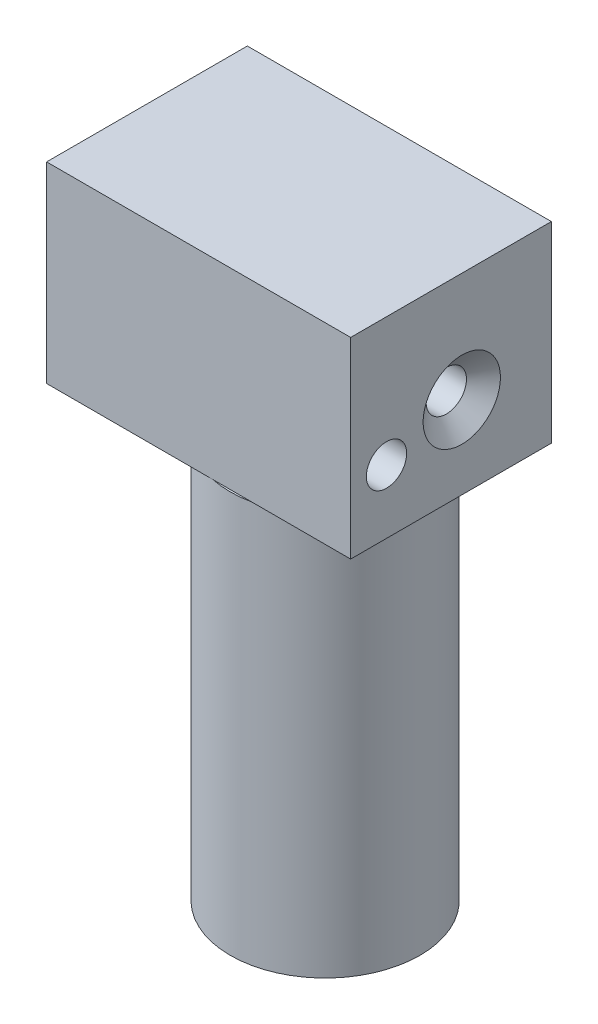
ISO-10303-21;
HEADER;
FILE_DESCRIPTION(('STEP AP214'),'2;1');
FILE_NAME('part.step','',(''),(''),'','','');
FILE_SCHEMA(('AUTOMOTIVE_DESIGN { 1 0 10303 214 1 1 1 1 }'));
ENDSEC;
DATA;
#1=APPLICATION_CONTEXT('core data for automotive mechanical design processes');
#2=APPLICATION_PROTOCOL_DEFINITION('international standard','automotive_design',2000,#1);
#3=PRODUCT_CONTEXT('',#1,'mechanical');
#4=PRODUCT('Part','Part','',(#3));
#5=PRODUCT_RELATED_PRODUCT_CATEGORY('part','',(#4));
#6=PRODUCT_DEFINITION_FORMATION('','',#4);
#7=PRODUCT_DEFINITION_CONTEXT('part definition',#1,'design');
#8=PRODUCT_DEFINITION('design','',#6,#7);
#9=PRODUCT_DEFINITION_SHAPE('','',#8);
#10=(LENGTH_UNIT() NAMED_UNIT(*) SI_UNIT(.MILLI.,.METRE.));
#11=(NAMED_UNIT(*) PLANE_ANGLE_UNIT() SI_UNIT($,.RADIAN.));
#12=(NAMED_UNIT(*) SI_UNIT($,.STERADIAN.) SOLID_ANGLE_UNIT());
#13=UNCERTAINTY_MEASURE_WITH_UNIT(LENGTH_MEASURE(1.E-05),#10,'distance_accuracy_value','');
#14=(GEOMETRIC_REPRESENTATION_CONTEXT(3) GLOBAL_UNCERTAINTY_ASSIGNED_CONTEXT((#13)) GLOBAL_UNIT_ASSIGNED_CONTEXT((#10,
#11,#12)) REPRESENTATION_CONTEXT('',''));
#15=CARTESIAN_POINT('',(0.,0.,0.));
#16=DIRECTION('',(0.,0.,1.));
#17=DIRECTION('',(1.,0.,0.));
#18=AXIS2_PLACEMENT_3D('',#15,#16,#17);
#19=CARTESIAN_POINT('',(-8.73607897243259,-5.44469898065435,25.4));
#20=DIRECTION('',(0.,1.,0.));
#21=DIRECTION('',(0.,0.,1.));
#22=AXIS2_PLACEMENT_3D('',#19,#20,#21);
#23=PLANE('',#22);
#24=CARTESIAN_POINT('',(14.7615659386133,-5.44469898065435,13.6554974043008));
#25=DIRECTION('',(0.,-1.,0.));
#26=DIRECTION('',(0.,0.,-1.));
#27=AXIS2_PLACEMENT_3D('',#24,#25,#26);
#28=CIRCLE('',#27,12.0013083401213);
#29=CARTESIAN_POINT('',(12.2921407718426,-5.44469898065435,25.4));
#30=VERTEX_POINT('',#29);
#31=CARTESIAN_POINT('',(17.230991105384,-5.44469898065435,25.4));
#32=VERTEX_POINT('',#31);
#33=EDGE_CURVE('E11',#30,#32,#28,.T.);
#34=ORIENTED_EDGE('',*,*,#33,.F.);
#35=DIRECTION('',(1.,0.,0.));
#36=VECTOR('',#35,1.);
#37=CARTESIAN_POINT('',(-8.73607897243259,-5.44469898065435,25.4));
#38=LINE('',#37,#36);
#39=CARTESIAN_POINT('',(-8.73607897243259,-5.44469898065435,25.4));
#40=VERTEX_POINT('',#39);
#41=EDGE_CURVE('E90',#40,#30,#38,.T.);
#42=ORIENTED_EDGE('',*,*,#41,.F.);
#43=DIRECTION('',(0.,0.,-1.));
#44=VECTOR('',#43,1.);
#45=CARTESIAN_POINT('',(-8.73607897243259,-5.44469898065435,25.4));
#46=LINE('',#45,#44);
#47=CARTESIAN_POINT('',(-8.73607897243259,-5.44469898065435,0.));
#48=VERTEX_POINT('',#47);
#49=EDGE_CURVE('E45',#40,#48,#46,.T.);
#50=ORIENTED_EDGE('',*,*,#49,.T.);
#51=DIRECTION('',(1.,0.,0.));
#52=VECTOR('',#51,1.);
#53=CARTESIAN_POINT('',(-8.73607897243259,-5.44469898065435,0.));
#54=LINE('',#53,#52);
#55=CARTESIAN_POINT('',(29.7403417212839,-5.44469898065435,0.));
#56=VERTEX_POINT('',#55);
#57=EDGE_CURVE('E138',#48,#56,#54,.T.);
#58=ORIENTED_EDGE('',*,*,#57,.T.);
#59=DIRECTION('',(0.,0.,-1.));
#60=VECTOR('',#59,1.);
#61=CARTESIAN_POINT('',(29.7403417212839,-5.44469898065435,25.4));
#62=LINE('',#61,#60);
#63=CARTESIAN_POINT('',(29.7403417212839,-5.44469898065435,25.4));
#64=VERTEX_POINT('',#63);
#65=EDGE_CURVE('E145',#64,#56,#62,.T.);
#66=ORIENTED_EDGE('',*,*,#65,.F.);
#67=EDGE_CURVE('E129',#32,#64,#38,.T.);
#68=ORIENTED_EDGE('',*,*,#67,.F.);
#69=EDGE_LOOP('',(#34,#42,#50,#58,#66,#68));
#70=FACE_BOUND('',#69,.T.);
#71=ADVANCED_FACE('F41',(#70),#23,.F.);
#72=CARTESIAN_POINT('',(-8.73607897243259,-5.44469898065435,25.4));
#73=DIRECTION('',(1.,0.,0.));
#74=DIRECTION('',(0.,0.,-1.));
#75=AXIS2_PLACEMENT_3D('',#72,#73,#74);
#76=PLANE('',#75);
#77=CARTESIAN_POINT('',(-8.73607897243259,4.98819251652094,11.3361126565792));
#78=DIRECTION('',(1.,0.,0.));
#79=DIRECTION('',(0.,0.,-1.));
#80=AXIS2_PLACEMENT_3D('',#77,#78,#79);
#81=CIRCLE('',#80,2.55269999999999);
#82=CARTESIAN_POINT('',(-8.73607897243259,4.98819251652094,8.7834126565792));
#83=VERTEX_POINT('',#82);
#84=EDGE_CURVE('E108',#83,#83,#81,.T.);
#85=ORIENTED_EDGE('',*,*,#84,.T.);
#86=EDGE_LOOP('',(#85));
#87=FACE_BOUND('',#86,.T.);
#88=DIRECTION('',(0.,-1.,0.));
#89=VECTOR('',#88,1.);
#90=CARTESIAN_POINT('',(-8.73607897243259,-5.44469898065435,0.));
#91=LINE('',#90,#89);
#92=CARTESIAN_POINT('',(-8.73607897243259,18.8497076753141,0.));
#93=VERTEX_POINT('',#92);
#94=EDGE_CURVE('E124',#93,#48,#91,.T.);
#95=ORIENTED_EDGE('',*,*,#94,.T.);
#96=ORIENTED_EDGE('',*,*,#49,.F.);
#97=DIRECTION('',(0.,-1.,0.));
#98=VECTOR('',#97,1.);
#99=CARTESIAN_POINT('',(-8.73607897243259,-5.44469898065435,25.4));
#100=LINE('',#99,#98);
#101=CARTESIAN_POINT('',(-8.73607897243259,18.8497076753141,25.4));
#102=VERTEX_POINT('',#101);
#103=EDGE_CURVE('E127',#102,#40,#100,.T.);
#104=ORIENTED_EDGE('',*,*,#103,.F.);
#105=DIRECTION('',(0.,0.,-1.));
#106=VECTOR('',#105,1.);
#107=CARTESIAN_POINT('',(-8.73607897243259,18.8497076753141,25.4));
#108=LINE('',#107,#106);
#109=EDGE_CURVE('E135',#102,#93,#108,.T.);
#110=ORIENTED_EDGE('',*,*,#109,.T.);
#111=EDGE_LOOP('',(#95,#96,#104,#110));
#112=FACE_BOUND('',#111,.T.);
#113=ADVANCED_FACE('F43',(#87,#112),#76,.F.);
#114=CARTESIAN_POINT('',(29.7403417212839,-5.44469898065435,25.4));
#115=DIRECTION('',(-1.,0.,0.));
#116=DIRECTION('',(0.,0.,1.));
#117=AXIS2_PLACEMENT_3D('',#114,#115,#116);
#118=PLANE('',#117);
#119=CARTESIAN_POINT('',(29.7403417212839,2.60694251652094,20.8611126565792));
#120=DIRECTION('',(1.,0.,0.));
#121=DIRECTION('',(0.,0.,-1.));
#122=AXIS2_PLACEMENT_3D('',#119,#120,#121);
#123=CIRCLE('',#122,2.5527);
#124=CARTESIAN_POINT('',(29.7403417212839,2.60694251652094,18.3084126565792));
#125=VERTEX_POINT('',#124);
#126=EDGE_CURVE('E109',#125,#125,#123,.T.);
#127=ORIENTED_EDGE('',*,*,#126,.F.);
#128=EDGE_LOOP('',(#127));
#129=FACE_BOUND('',#128,.T.);
#130=CARTESIAN_POINT('',(29.7403417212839,4.98819251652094,11.3361126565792));
#131=DIRECTION('',(1.,0.,0.));
#132=DIRECTION('',(0.,0.,-1.));
#133=AXIS2_PLACEMENT_3D('',#130,#131,#132);
#134=CIRCLE('',#133,4.8895);
#135=CARTESIAN_POINT('',(29.7403417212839,4.98819251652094,6.44661265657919));
#136=VERTEX_POINT('',#135);
#137=EDGE_CURVE('E119',#136,#136,#134,.T.);
#138=ORIENTED_EDGE('',*,*,#137,.F.);
#139=EDGE_LOOP('',(#138));
#140=FACE_BOUND('',#139,.T.);
#141=DIRECTION('',(0.,1.,0.));
#142=VECTOR('',#141,1.);
#143=CARTESIAN_POINT('',(29.7403417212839,-5.44469898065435,0.));
#144=LINE('',#143,#142);
#145=CARTESIAN_POINT('',(29.7403417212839,18.8497076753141,0.));
#146=VERTEX_POINT('',#145);
#147=EDGE_CURVE('E140',#56,#146,#144,.T.);
#148=ORIENTED_EDGE('',*,*,#147,.T.);
#149=DIRECTION('',(0.,0.,-1.));
#150=VECTOR('',#149,1.);
#151=CARTESIAN_POINT('',(29.7403417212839,18.8497076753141,25.4));
#152=LINE('',#151,#150);
#153=CARTESIAN_POINT('',(29.7403417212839,18.8497076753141,25.4));
#154=VERTEX_POINT('',#153);
#155=EDGE_CURVE('E144',#154,#146,#152,.T.);
#156=ORIENTED_EDGE('',*,*,#155,.F.);
#157=DIRECTION('',(0.,1.,0.));
#158=VECTOR('',#157,1.);
#159=CARTESIAN_POINT('',(29.7403417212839,-5.44469898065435,25.4));
#160=LINE('',#159,#158);
#161=EDGE_CURVE('E131',#64,#154,#160,.T.);
#162=ORIENTED_EDGE('',*,*,#161,.F.);
#163=ORIENTED_EDGE('',*,*,#65,.T.);
#164=EDGE_LOOP('',(#148,#156,#162,#163));
#165=FACE_BOUND('',#164,.T.);
#166=ADVANCED_FACE('F158',(#129,#140,#165),#118,.F.);
#167=CARTESIAN_POINT('',(-8.73607897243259,18.8497076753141,25.4));
#168=DIRECTION('',(0.,-1.,0.));
#169=DIRECTION('',(0.,0.,-1.));
#170=AXIS2_PLACEMENT_3D('',#167,#168,#169);
#171=PLANE('',#170);
#172=DIRECTION('',(-1.,0.,0.));
#173=VECTOR('',#172,1.);
#174=CARTESIAN_POINT('',(-8.73607897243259,18.8497076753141,0.));
#175=LINE('',#174,#173);
#176=EDGE_CURVE('E86',#146,#93,#175,.T.);
#177=ORIENTED_EDGE('',*,*,#176,.T.);
#178=ORIENTED_EDGE('',*,*,#109,.F.);
#179=DIRECTION('',(-1.,0.,0.));
#180=VECTOR('',#179,1.);
#181=CARTESIAN_POINT('',(-8.73607897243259,18.8497076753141,25.4));
#182=LINE('',#181,#180);
#183=EDGE_CURVE('E65',#154,#102,#182,.T.);
#184=ORIENTED_EDGE('',*,*,#183,.F.);
#185=ORIENTED_EDGE('',*,*,#155,.T.);
#186=EDGE_LOOP('',(#177,#178,#184,#185));
#187=FACE_BOUND('',#186,.T.);
#188=ADVANCED_FACE('F159',(#187),#171,.F.);
#189=CARTESIAN_POINT('',(-8.73607897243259,18.8497076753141,25.4));
#190=DIRECTION('',(0.,0.,-1.));
#191=DIRECTION('',(-1.,0.,0.));
#192=AXIS2_PLACEMENT_3D('',#189,#190,#191);
#193=PLANE('',#192);
#194=ORIENTED_EDGE('',*,*,#103,.T.);
#195=ORIENTED_EDGE('',*,*,#41,.T.);
#196=EDGE_CURVE('E132',#30,#32,#38,.T.);
#197=ORIENTED_EDGE('',*,*,#196,.T.);
#198=ORIENTED_EDGE('',*,*,#67,.T.);
#199=ORIENTED_EDGE('',*,*,#161,.T.);
#200=ORIENTED_EDGE('',*,*,#183,.T.);
#201=EDGE_LOOP('',(#194,#195,#197,#198,#199,#200));
#202=FACE_BOUND('',#201,.T.);
#203=ADVANCED_FACE('F160',(#202),#193,.F.);
#204=CARTESIAN_POINT('',(-8.73607897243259,18.8497076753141,0.));
#205=DIRECTION('',(0.,0.,-1.));
#206=DIRECTION('',(-1.,0.,0.));
#207=AXIS2_PLACEMENT_3D('',#204,#205,#206);
#208=PLANE('',#207);
#209=ORIENTED_EDGE('',*,*,#94,.F.);
#210=ORIENTED_EDGE('',*,*,#176,.F.);
#211=ORIENTED_EDGE('',*,*,#147,.F.);
#212=ORIENTED_EDGE('',*,*,#57,.F.);
#213=EDGE_LOOP('',(#209,#210,#211,#212));
#214=FACE_BOUND('',#213,.T.);
#215=ADVANCED_FACE('F156',(#214),#208,.T.);
#216=CARTESIAN_POINT('',(14.7615659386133,-56.2446989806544,13.6554974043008));
#217=DIRECTION('',(0.,1.,0.));
#218=DIRECTION('',(0.,0.,1.));
#219=AXIS2_PLACEMENT_3D('',#216,#217,#218);
#220=CYLINDRICAL_SURFACE('',#219,12.0013083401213);
#221=CARTESIAN_POINT('',(14.7615659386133,-56.2446989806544,13.6554974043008));
#222=DIRECTION('',(0.,-1.,0.));
#223=DIRECTION('',(0.,0.,-1.));
#224=AXIS2_PLACEMENT_3D('',#221,#222,#223);
#225=CIRCLE('',#224,12.0013083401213);
#226=CARTESIAN_POINT('',(14.7615659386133,-56.2446989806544,1.65418906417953));
#227=VERTEX_POINT('',#226);
#228=EDGE_CURVE('E122',#227,#227,#225,.T.);
#229=ORIENTED_EDGE('',*,*,#228,.F.);
#230=EDGE_LOOP('',(#229));
#231=FACE_BOUND('',#230,.T.);
#232=EDGE_CURVE('E51',#32,#30,#28,.T.);
#233=ORIENTED_EDGE('',*,*,#232,.T.);
#234=ORIENTED_EDGE('',*,*,#33,.T.);
#235=EDGE_LOOP('',(#233,#234));
#236=FACE_BOUND('',#235,.T.);
#237=ADVANCED_FACE('F166',(#231,#236),#220,.T.);
#238=CARTESIAN_POINT('',(14.7615659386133,-56.2446989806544,13.6554974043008));
#239=DIRECTION('',(0.,-1.,0.));
#240=DIRECTION('',(0.,0.,-1.));
#241=AXIS2_PLACEMENT_3D('',#238,#239,#240);
#242=PLANE('',#241);
#243=ORIENTED_EDGE('',*,*,#228,.T.);
#244=EDGE_LOOP('',(#243));
#245=FACE_BOUND('',#244,.T.);
#246=ADVANCED_FACE('F168',(#245),#242,.T.);
#247=CARTESIAN_POINT('',(14.7615659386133,-5.44469898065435,13.6554974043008));
#248=DIRECTION('',(0.,-1.,0.));
#249=DIRECTION('',(0.,0.,-1.));
#250=AXIS2_PLACEMENT_3D('',#247,#248,#249);
#251=PLANE('',#250);
#252=ORIENTED_EDGE('',*,*,#196,.F.);
#253=ORIENTED_EDGE('',*,*,#232,.F.);
#254=EDGE_LOOP('',(#252,#253));
#255=FACE_BOUND('',#254,.T.);
#256=ADVANCED_FACE('F164',(#255),#251,.F.);
#257=CARTESIAN_POINT('',(29.7403417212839,4.98819251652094,11.3361126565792));
#258=DIRECTION('',(1.,0.,0.));
#259=DIRECTION('',(0.,0.,-1.));
#260=AXIS2_PLACEMENT_3D('',#257,#258,#259);
#261=CONICAL_SURFACE('',#260,4.8895,0.872664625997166);
#262=CARTESIAN_POINT('',(27.7795337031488,4.98819251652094,11.3361126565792));
#263=DIRECTION('',(1.,0.,0.));
#264=DIRECTION('',(0.,0.,-1.));
#265=AXIS2_PLACEMENT_3D('',#262,#263,#264);
#266=CIRCLE('',#265,2.5527);
#267=CARTESIAN_POINT('',(27.7795337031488,4.98819251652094,8.78341265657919));
#268=VERTEX_POINT('',#267);
#269=EDGE_CURVE('E112',#268,#268,#266,.T.);
#270=ORIENTED_EDGE('',*,*,#269,.F.);
#271=EDGE_LOOP('',(#270));
#272=FACE_BOUND('',#271,.T.);
#273=ORIENTED_EDGE('',*,*,#137,.T.);
#274=EDGE_LOOP('',(#273));
#275=FACE_BOUND('',#274,.T.);
#276=ADVANCED_FACE('F220',(#272,#275),#261,.F.);
#277=CARTESIAN_POINT('',(29.7403417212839,4.98819251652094,11.3361126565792));
#278=DIRECTION('',(1.,0.,0.));
#279=DIRECTION('',(0.,0.,-1.));
#280=AXIS2_PLACEMENT_3D('',#277,#278,#279);
#281=CYLINDRICAL_SURFACE('',#280,2.55269999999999);
#282=ORIENTED_EDGE('',*,*,#84,.F.);
#283=EDGE_LOOP('',(#282));
#284=FACE_BOUND('',#283,.T.);
#285=ORIENTED_EDGE('',*,*,#269,.T.);
#286=EDGE_LOOP('',(#285));
#287=FACE_BOUND('',#286,.T.);
#288=ADVANCED_FACE('F102',(#284,#287),#281,.F.);
#289=CARTESIAN_POINT('',(10.6903417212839,2.60694251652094,20.8611126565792));
#290=DIRECTION('',(1.,0.,0.));
#291=DIRECTION('',(0.,0.,-1.));
#292=AXIS2_PLACEMENT_3D('',#289,#290,#291);
#293=CONICAL_SURFACE('',#292,2.55269999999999,1.02974425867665);
#294=CARTESIAN_POINT('',(9.15652481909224,2.60694251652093,20.8611126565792));
#295=VERTEX_POINT('',#294);
#296=VERTEX_LOOP('',#295);
#297=FACE_BOUND('',#296,.T.);
#298=CARTESIAN_POINT('',(10.6903417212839,2.60694251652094,20.8611126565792));
#299=DIRECTION('',(1.,0.,0.));
#300=DIRECTION('',(0.,0.,-1.));
#301=AXIS2_PLACEMENT_3D('',#298,#299,#300);
#302=CIRCLE('',#301,2.55269999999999);
#303=CARTESIAN_POINT('',(10.6903417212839,2.60694251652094,18.3084126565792));
#304=VERTEX_POINT('',#303);
#305=EDGE_CURVE('E106',#304,#304,#302,.T.);
#306=ORIENTED_EDGE('',*,*,#305,.T.);
#307=EDGE_LOOP('',(#306));
#308=FACE_BOUND('',#307,.T.);
#309=ADVANCED_FACE('F98',(#297,#308),#293,.F.);
#310=CARTESIAN_POINT('',(29.7403417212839,2.60694251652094,20.8611126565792));
#311=DIRECTION('',(1.,0.,0.));
#312=DIRECTION('',(0.,0.,-1.));
#313=AXIS2_PLACEMENT_3D('',#310,#311,#312);
#314=CYLINDRICAL_SURFACE('',#313,2.5527);
#315=ORIENTED_EDGE('',*,*,#305,.F.);
#316=EDGE_LOOP('',(#315));
#317=FACE_BOUND('',#316,.T.);
#318=ORIENTED_EDGE('',*,*,#126,.T.);
#319=EDGE_LOOP('',(#318));
#320=FACE_BOUND('',#319,.T.);
#321=ADVANCED_FACE('F101',(#317,#320),#314,.F.);
#322=CLOSED_SHELL('',(#71,#113,#166,#188,#203,#215,#237,#246,#256,#276,#288,#309,#321));
#323=MANIFOLD_SOLID_BREP('B2',#322);
#324=ADVANCED_BREP_SHAPE_REPRESENTATION('',(#18,#323),#14);
#325=SHAPE_DEFINITION_REPRESENTATION(#9,#324);
ENDSEC;
END-ISO-10303-21;
